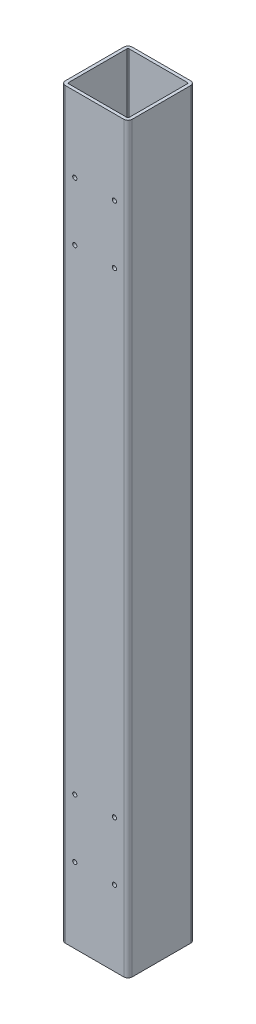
ISO-10303-21;
HEADER;
FILE_DESCRIPTION(('STEP AP214'),'2;1');
FILE_NAME('part.step','',(''),(''),'','','');
FILE_SCHEMA(('AUTOMOTIVE_DESIGN { 1 0 10303 214 1 1 1 1 }'));
ENDSEC;
DATA;
#1=APPLICATION_CONTEXT('core data for automotive mechanical design processes');
#2=APPLICATION_PROTOCOL_DEFINITION('international standard','automotive_design',2000,#1);
#3=PRODUCT_CONTEXT('',#1,'mechanical');
#4=PRODUCT('Part','Part','',(#3));
#5=PRODUCT_RELATED_PRODUCT_CATEGORY('part','',(#4));
#6=PRODUCT_DEFINITION_FORMATION('','',#4);
#7=PRODUCT_DEFINITION_CONTEXT('part definition',#1,'design');
#8=PRODUCT_DEFINITION('design','',#6,#7);
#9=PRODUCT_DEFINITION_SHAPE('','',#8);
#10=(LENGTH_UNIT() NAMED_UNIT(*) SI_UNIT(.MILLI.,.METRE.));
#11=(NAMED_UNIT(*) PLANE_ANGLE_UNIT() SI_UNIT($,.RADIAN.));
#12=(NAMED_UNIT(*) SI_UNIT($,.STERADIAN.) SOLID_ANGLE_UNIT());
#13=UNCERTAINTY_MEASURE_WITH_UNIT(LENGTH_MEASURE(1.E-05),#10,'distance_accuracy_value','');
#14=(GEOMETRIC_REPRESENTATION_CONTEXT(3) GLOBAL_UNCERTAINTY_ASSIGNED_CONTEXT((#13)) GLOBAL_UNIT_ASSIGNED_CONTEXT((#10,
#11,#12)) REPRESENTATION_CONTEXT('',''));
#15=CARTESIAN_POINT('',(0.,0.,0.));
#16=DIRECTION('',(0.,0.,1.));
#17=DIRECTION('',(1.,0.,0.));
#18=AXIS2_PLACEMENT_3D('',#15,#16,#17);
#19=CARTESIAN_POINT('',(-30.1624999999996,-450.849999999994,50.7999999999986));
#20=DIRECTION('',(0.,0.,1.));
#21=DIRECTION('',(1.,0.,0.));
#22=AXIS2_PLACEMENT_3D('',#19,#20,#21);
#23=CYLINDRICAL_SURFACE('',#22,3.175);
#24=CARTESIAN_POINT('',(-30.1624999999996,-450.849999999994,50.8));
#25=DIRECTION('',(0.,0.,1.));
#26=DIRECTION('',(1.,0.,0.));
#27=AXIS2_PLACEMENT_3D('',#24,#25,#26);
#28=CIRCLE('',#27,3.175);
#29=CARTESIAN_POINT('',(-33.3374999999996,-450.849999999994,50.8));
#30=VERTEX_POINT('',#29);
#31=CARTESIAN_POINT('',(-26.9874999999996,-450.849999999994,50.8));
#32=VERTEX_POINT('',#31);
#33=EDGE_CURVE('E361',#30,#32,#28,.F.);
#34=ORIENTED_EDGE('',*,*,#33,.F.);
#35=DIRECTION('',(0.,0.,1.));
#36=VECTOR('',#35,1.);
#37=CARTESIAN_POINT('',(-33.3374999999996,-450.849999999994,50.7999999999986));
#38=LINE('',#37,#36);
#39=CARTESIAN_POINT('',(-33.3374999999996,-450.849999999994,46.0375));
#40=VERTEX_POINT('',#39);
#41=EDGE_CURVE('E203',#30,#40,#38,.F.);
#42=ORIENTED_EDGE('',*,*,#41,.T.);
#43=CARTESIAN_POINT('',(-30.1624999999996,-450.849999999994,46.0375));
#44=DIRECTION('',(0.,0.,1.));
#45=DIRECTION('',(1.,0.,0.));
#46=AXIS2_PLACEMENT_3D('',#43,#44,#45);
#47=CIRCLE('',#46,3.175);
#48=CARTESIAN_POINT('',(-26.9874999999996,-450.849999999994,46.0375));
#49=VERTEX_POINT('',#48);
#50=EDGE_CURVE('E19',#40,#49,#47,.F.);
#51=ORIENTED_EDGE('',*,*,#50,.T.);
#52=DIRECTION('',(0.,0.,1.));
#53=VECTOR('',#52,1.);
#54=CARTESIAN_POINT('',(-26.9874999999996,-450.849999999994,50.7999999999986));
#55=LINE('',#54,#53);
#56=EDGE_CURVE('E195',#49,#32,#55,.T.);
#57=ORIENTED_EDGE('',*,*,#56,.T.);
#58=EDGE_LOOP('',(#34,#42,#51,#57));
#59=FACE_BOUND('',#58,.T.);
#60=ADVANCED_FACE('F16',(#59),#23,.F.);
#61=CARTESIAN_POINT('',(-30.1624999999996,-450.849999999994,50.7999999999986));
#62=DIRECTION('',(0.,0.,1.));
#63=DIRECTION('',(1.,0.,0.));
#64=AXIS2_PLACEMENT_3D('',#61,#62,#63);
#65=CYLINDRICAL_SURFACE('',#64,3.175);
#66=CARTESIAN_POINT('',(-30.1624999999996,-450.849999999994,46.0375));
#67=DIRECTION('',(0.,0.,1.));
#68=DIRECTION('',(1.,0.,0.));
#69=AXIS2_PLACEMENT_3D('',#66,#67,#68);
#70=CIRCLE('',#69,3.175);
#71=EDGE_CURVE('E197',#49,#40,#70,.F.);
#72=ORIENTED_EDGE('',*,*,#71,.T.);
#73=ORIENTED_EDGE('',*,*,#41,.F.);
#74=CARTESIAN_POINT('',(-30.1624999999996,-450.849999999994,50.8));
#75=DIRECTION('',(0.,0.,1.));
#76=DIRECTION('',(1.,0.,0.));
#77=AXIS2_PLACEMENT_3D('',#74,#75,#76);
#78=CIRCLE('',#77,3.175);
#79=EDGE_CURVE('E199',#32,#30,#78,.F.);
#80=ORIENTED_EDGE('',*,*,#79,.F.);
#81=ORIENTED_EDGE('',*,*,#56,.F.);
#82=EDGE_LOOP('',(#72,#73,#80,#81));
#83=FACE_BOUND('',#82,.T.);
#84=ADVANCED_FACE('F196',(#83),#65,.F.);
#85=CARTESIAN_POINT('',(30.1625000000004,-450.849999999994,50.7999999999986));
#86=DIRECTION('',(0.,0.,1.));
#87=DIRECTION('',(1.,0.,0.));
#88=AXIS2_PLACEMENT_3D('',#85,#86,#87);
#89=CYLINDRICAL_SURFACE('',#88,3.175);
#90=CARTESIAN_POINT('',(30.1625000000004,-450.849999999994,50.8));
#91=DIRECTION('',(0.,0.,1.));
#92=DIRECTION('',(1.,0.,0.));
#93=AXIS2_PLACEMENT_3D('',#90,#91,#92);
#94=CIRCLE('',#93,3.175);
#95=CARTESIAN_POINT('',(26.9875000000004,-450.849999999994,50.8));
#96=VERTEX_POINT('',#95);
#97=CARTESIAN_POINT('',(33.3375000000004,-450.849999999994,50.8));
#98=VERTEX_POINT('',#97);
#99=EDGE_CURVE('E358',#96,#98,#94,.F.);
#100=ORIENTED_EDGE('',*,*,#99,.F.);
#101=DIRECTION('',(0.,0.,1.));
#102=VECTOR('',#101,1.);
#103=CARTESIAN_POINT('',(26.9875000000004,-450.849999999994,50.7999999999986));
#104=LINE('',#103,#102);
#105=CARTESIAN_POINT('',(26.9875000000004,-450.849999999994,46.0375));
#106=VERTEX_POINT('',#105);
#107=EDGE_CURVE('E202',#96,#106,#104,.F.);
#108=ORIENTED_EDGE('',*,*,#107,.T.);
#109=CARTESIAN_POINT('',(30.1625000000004,-450.849999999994,46.0375));
#110=DIRECTION('',(0.,0.,1.));
#111=DIRECTION('',(1.,0.,0.));
#112=AXIS2_PLACEMENT_3D('',#109,#110,#111);
#113=CIRCLE('',#112,3.175);
#114=CARTESIAN_POINT('',(33.3375000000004,-450.849999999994,46.0375));
#115=VERTEX_POINT('',#114);
#116=EDGE_CURVE('E206',#106,#115,#113,.F.);
#117=ORIENTED_EDGE('',*,*,#116,.T.);
#118=DIRECTION('',(0.,0.,1.));
#119=VECTOR('',#118,1.);
#120=CARTESIAN_POINT('',(33.3375000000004,-450.849999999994,50.7999999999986));
#121=LINE('',#120,#119);
#122=EDGE_CURVE('E260',#115,#98,#121,.T.);
#123=ORIENTED_EDGE('',*,*,#122,.T.);
#124=EDGE_LOOP('',(#100,#108,#117,#123));
#125=FACE_BOUND('',#124,.T.);
#126=ADVANCED_FACE('F408',(#125),#89,.F.);
#127=CARTESIAN_POINT('',(30.1625000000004,-450.849999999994,50.7999999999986));
#128=DIRECTION('',(0.,0.,1.));
#129=DIRECTION('',(1.,0.,0.));
#130=AXIS2_PLACEMENT_3D('',#127,#128,#129);
#131=CYLINDRICAL_SURFACE('',#130,3.175);
#132=CARTESIAN_POINT('',(30.1625000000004,-450.849999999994,46.0375));
#133=DIRECTION('',(0.,0.,1.));
#134=DIRECTION('',(1.,0.,0.));
#135=AXIS2_PLACEMENT_3D('',#132,#133,#134);
#136=CIRCLE('',#135,3.175);
#137=EDGE_CURVE('E402',#115,#106,#136,.F.);
#138=ORIENTED_EDGE('',*,*,#137,.T.);
#139=ORIENTED_EDGE('',*,*,#107,.F.);
#140=CARTESIAN_POINT('',(30.1625000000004,-450.849999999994,50.8));
#141=DIRECTION('',(0.,0.,1.));
#142=DIRECTION('',(1.,0.,0.));
#143=AXIS2_PLACEMENT_3D('',#140,#141,#142);
#144=CIRCLE('',#143,3.175);
#145=EDGE_CURVE('E355',#98,#96,#144,.F.);
#146=ORIENTED_EDGE('',*,*,#145,.F.);
#147=ORIENTED_EDGE('',*,*,#122,.F.);
#148=EDGE_LOOP('',(#138,#139,#146,#147));
#149=FACE_BOUND('',#148,.T.);
#150=ADVANCED_FACE('F413',(#149),#131,.F.);
#151=CARTESIAN_POINT('',(-30.1624999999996,-361.949999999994,50.7999999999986));
#152=DIRECTION('',(0.,0.,1.));
#153=DIRECTION('',(1.,0.,0.));
#154=AXIS2_PLACEMENT_3D('',#151,#152,#153);
#155=CYLINDRICAL_SURFACE('',#154,3.175);
#156=CARTESIAN_POINT('',(-30.1624999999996,-361.949999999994,50.8));
#157=DIRECTION('',(0.,0.,1.));
#158=DIRECTION('',(1.,0.,0.));
#159=AXIS2_PLACEMENT_3D('',#156,#157,#158);
#160=CIRCLE('',#159,3.175);
#161=CARTESIAN_POINT('',(-33.3374999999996,-361.949999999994,50.8));
#162=VERTEX_POINT('',#161);
#163=CARTESIAN_POINT('',(-26.9874999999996,-361.949999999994,50.8));
#164=VERTEX_POINT('',#163);
#165=EDGE_CURVE('E352',#162,#164,#160,.F.);
#166=ORIENTED_EDGE('',*,*,#165,.F.);
#167=DIRECTION('',(0.,0.,1.));
#168=VECTOR('',#167,1.);
#169=CARTESIAN_POINT('',(-33.3374999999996,-361.949999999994,50.7999999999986));
#170=LINE('',#169,#168);
#171=CARTESIAN_POINT('',(-33.3374999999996,-361.949999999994,46.0375));
#172=VERTEX_POINT('',#171);
#173=EDGE_CURVE('E256',#162,#172,#170,.F.);
#174=ORIENTED_EDGE('',*,*,#173,.T.);
#175=CARTESIAN_POINT('',(-30.1624999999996,-361.949999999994,46.0375));
#176=DIRECTION('',(0.,0.,1.));
#177=DIRECTION('',(1.,0.,0.));
#178=AXIS2_PLACEMENT_3D('',#175,#176,#177);
#179=CIRCLE('',#178,3.175);
#180=CARTESIAN_POINT('',(-26.9874999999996,-361.949999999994,46.0375));
#181=VERTEX_POINT('',#180);
#182=EDGE_CURVE('E398',#172,#181,#179,.F.);
#183=ORIENTED_EDGE('',*,*,#182,.T.);
#184=DIRECTION('',(0.,0.,1.));
#185=VECTOR('',#184,1.);
#186=CARTESIAN_POINT('',(-26.9874999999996,-361.949999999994,50.7999999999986));
#187=LINE('',#186,#185);
#188=EDGE_CURVE('E252',#181,#164,#187,.T.);
#189=ORIENTED_EDGE('',*,*,#188,.T.);
#190=EDGE_LOOP('',(#166,#174,#183,#189));
#191=FACE_BOUND('',#190,.T.);
#192=ADVANCED_FACE('F671',(#191),#155,.F.);
#193=CARTESIAN_POINT('',(-30.1624999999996,-361.949999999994,50.7999999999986));
#194=DIRECTION('',(0.,0.,1.));
#195=DIRECTION('',(1.,0.,0.));
#196=AXIS2_PLACEMENT_3D('',#193,#194,#195);
#197=CYLINDRICAL_SURFACE('',#196,3.175);
#198=CARTESIAN_POINT('',(-30.1624999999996,-361.949999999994,46.0375));
#199=DIRECTION('',(0.,0.,1.));
#200=DIRECTION('',(1.,0.,0.));
#201=AXIS2_PLACEMENT_3D('',#198,#199,#200);
#202=CIRCLE('',#201,3.175);
#203=EDGE_CURVE('E394',#181,#172,#202,.F.);
#204=ORIENTED_EDGE('',*,*,#203,.T.);
#205=ORIENTED_EDGE('',*,*,#173,.F.);
#206=CARTESIAN_POINT('',(-30.1624999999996,-361.949999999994,50.8));
#207=DIRECTION('',(0.,0.,1.));
#208=DIRECTION('',(1.,0.,0.));
#209=AXIS2_PLACEMENT_3D('',#206,#207,#208);
#210=CIRCLE('',#209,3.175);
#211=EDGE_CURVE('E348',#164,#162,#210,.F.);
#212=ORIENTED_EDGE('',*,*,#211,.F.);
#213=ORIENTED_EDGE('',*,*,#188,.F.);
#214=EDGE_LOOP('',(#204,#205,#212,#213));
#215=FACE_BOUND('',#214,.T.);
#216=ADVANCED_FACE('F667',(#215),#197,.F.);
#217=CARTESIAN_POINT('',(30.1625000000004,-361.949999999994,50.7999999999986));
#218=DIRECTION('',(0.,0.,1.));
#219=DIRECTION('',(1.,0.,0.));
#220=AXIS2_PLACEMENT_3D('',#217,#218,#219);
#221=CYLINDRICAL_SURFACE('',#220,3.175);
#222=CARTESIAN_POINT('',(30.1625000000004,-361.949999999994,50.8));
#223=DIRECTION('',(0.,0.,1.));
#224=DIRECTION('',(1.,0.,0.));
#225=AXIS2_PLACEMENT_3D('',#222,#223,#224);
#226=CIRCLE('',#225,3.175);
#227=CARTESIAN_POINT('',(26.9875000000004,-361.949999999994,50.8));
#228=VERTEX_POINT('',#227);
#229=CARTESIAN_POINT('',(33.3375000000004,-361.949999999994,50.8));
#230=VERTEX_POINT('',#229);
#231=EDGE_CURVE('E346',#228,#230,#226,.F.);
#232=ORIENTED_EDGE('',*,*,#231,.F.);
#233=DIRECTION('',(0.,0.,1.));
#234=VECTOR('',#233,1.);
#235=CARTESIAN_POINT('',(26.9875000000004,-361.949999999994,50.7999999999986));
#236=LINE('',#235,#234);
#237=CARTESIAN_POINT('',(26.9875000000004,-361.949999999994,46.0375));
#238=VERTEX_POINT('',#237);
#239=EDGE_CURVE('E249',#228,#238,#236,.F.);
#240=ORIENTED_EDGE('',*,*,#239,.T.);
#241=CARTESIAN_POINT('',(30.1625000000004,-361.949999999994,46.0375));
#242=DIRECTION('',(0.,0.,1.));
#243=DIRECTION('',(1.,0.,0.));
#244=AXIS2_PLACEMENT_3D('',#241,#242,#243);
#245=CIRCLE('',#244,3.175);
#246=CARTESIAN_POINT('',(33.3375000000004,-361.949999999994,46.0375));
#247=VERTEX_POINT('',#246);
#248=EDGE_CURVE('E391',#238,#247,#245,.F.);
#249=ORIENTED_EDGE('',*,*,#248,.T.);
#250=DIRECTION('',(0.,0.,1.));
#251=VECTOR('',#250,1.);
#252=CARTESIAN_POINT('',(33.3375000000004,-361.949999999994,50.7999999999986));
#253=LINE('',#252,#251);
#254=EDGE_CURVE('E246',#247,#230,#253,.T.);
#255=ORIENTED_EDGE('',*,*,#254,.T.);
#256=EDGE_LOOP('',(#232,#240,#249,#255));
#257=FACE_BOUND('',#256,.T.);
#258=ADVANCED_FACE('F663',(#257),#221,.F.);
#259=CARTESIAN_POINT('',(30.1625000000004,-361.949999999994,50.7999999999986));
#260=DIRECTION('',(0.,0.,1.));
#261=DIRECTION('',(1.,0.,0.));
#262=AXIS2_PLACEMENT_3D('',#259,#260,#261);
#263=CYLINDRICAL_SURFACE('',#262,3.175);
#264=CARTESIAN_POINT('',(30.1625000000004,-361.949999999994,46.0375));
#265=DIRECTION('',(0.,0.,1.));
#266=DIRECTION('',(1.,0.,0.));
#267=AXIS2_PLACEMENT_3D('',#264,#265,#266);
#268=CIRCLE('',#267,3.175);
#269=EDGE_CURVE('E388',#247,#238,#268,.F.);
#270=ORIENTED_EDGE('',*,*,#269,.T.);
#271=ORIENTED_EDGE('',*,*,#239,.F.);
#272=CARTESIAN_POINT('',(30.1625000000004,-361.949999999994,50.8));
#273=DIRECTION('',(0.,0.,1.));
#274=DIRECTION('',(1.,0.,0.));
#275=AXIS2_PLACEMENT_3D('',#272,#273,#274);
#276=CIRCLE('',#275,3.175);
#277=EDGE_CURVE('E343',#230,#228,#276,.F.);
#278=ORIENTED_EDGE('',*,*,#277,.F.);
#279=ORIENTED_EDGE('',*,*,#254,.F.);
#280=EDGE_LOOP('',(#270,#271,#278,#279));
#281=FACE_BOUND('',#280,.T.);
#282=ADVANCED_FACE('F659',(#281),#263,.F.);
#283=CARTESIAN_POINT('',(-30.1624999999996,361.950000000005,50.7999999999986));
#284=DIRECTION('',(0.,0.,1.));
#285=DIRECTION('',(1.,0.,0.));
#286=AXIS2_PLACEMENT_3D('',#283,#284,#285);
#287=CYLINDRICAL_SURFACE('',#286,3.175);
#288=CARTESIAN_POINT('',(-30.1624999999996,361.950000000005,50.8));
#289=DIRECTION('',(0.,0.,1.));
#290=DIRECTION('',(1.,0.,0.));
#291=AXIS2_PLACEMENT_3D('',#288,#289,#290);
#292=CIRCLE('',#291,3.175);
#293=CARTESIAN_POINT('',(-33.3374999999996,361.950000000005,50.8));
#294=VERTEX_POINT('',#293);
#295=CARTESIAN_POINT('',(-26.9874999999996,361.950000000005,50.8));
#296=VERTEX_POINT('',#295);
#297=EDGE_CURVE('E341',#294,#296,#292,.F.);
#298=ORIENTED_EDGE('',*,*,#297,.F.);
#299=DIRECTION('',(0.,0.,1.));
#300=VECTOR('',#299,1.);
#301=CARTESIAN_POINT('',(-33.3374999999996,361.950000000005,50.7999999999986));
#302=LINE('',#301,#300);
#303=CARTESIAN_POINT('',(-33.3374999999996,361.950000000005,46.0375));
#304=VERTEX_POINT('',#303);
#305=EDGE_CURVE('E243',#294,#304,#302,.F.);
#306=ORIENTED_EDGE('',*,*,#305,.T.);
#307=CARTESIAN_POINT('',(-30.1624999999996,361.950000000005,46.0375));
#308=DIRECTION('',(0.,0.,1.));
#309=DIRECTION('',(1.,0.,0.));
#310=AXIS2_PLACEMENT_3D('',#307,#308,#309);
#311=CIRCLE('',#310,3.175);
#312=CARTESIAN_POINT('',(-26.9874999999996,361.950000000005,46.0375));
#313=VERTEX_POINT('',#312);
#314=EDGE_CURVE('E385',#304,#313,#311,.F.);
#315=ORIENTED_EDGE('',*,*,#314,.T.);
#316=DIRECTION('',(0.,0.,1.));
#317=VECTOR('',#316,1.);
#318=CARTESIAN_POINT('',(-26.9874999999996,361.950000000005,50.7999999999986));
#319=LINE('',#318,#317);
#320=EDGE_CURVE('E240',#313,#296,#319,.T.);
#321=ORIENTED_EDGE('',*,*,#320,.T.);
#322=EDGE_LOOP('',(#298,#306,#315,#321));
#323=FACE_BOUND('',#322,.T.);
#324=ADVANCED_FACE('F655',(#323),#287,.F.);
#325=CARTESIAN_POINT('',(-30.1624999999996,361.950000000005,50.7999999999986));
#326=DIRECTION('',(0.,0.,1.));
#327=DIRECTION('',(1.,0.,0.));
#328=AXIS2_PLACEMENT_3D('',#325,#326,#327);
#329=CYLINDRICAL_SURFACE('',#328,3.175);
#330=CARTESIAN_POINT('',(-30.1624999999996,361.950000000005,46.0375));
#331=DIRECTION('',(0.,0.,1.));
#332=DIRECTION('',(1.,0.,0.));
#333=AXIS2_PLACEMENT_3D('',#330,#331,#332);
#334=CIRCLE('',#333,3.175);
#335=EDGE_CURVE('E382',#313,#304,#334,.F.);
#336=ORIENTED_EDGE('',*,*,#335,.T.);
#337=ORIENTED_EDGE('',*,*,#305,.F.);
#338=CARTESIAN_POINT('',(-30.1624999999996,361.950000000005,50.8));
#339=DIRECTION('',(0.,0.,1.));
#340=DIRECTION('',(1.,0.,0.));
#341=AXIS2_PLACEMENT_3D('',#338,#339,#340);
#342=CIRCLE('',#341,3.175);
#343=EDGE_CURVE('E338',#296,#294,#342,.F.);
#344=ORIENTED_EDGE('',*,*,#343,.F.);
#345=ORIENTED_EDGE('',*,*,#320,.F.);
#346=EDGE_LOOP('',(#336,#337,#344,#345));
#347=FACE_BOUND('',#346,.T.);
#348=ADVANCED_FACE('F651',(#347),#329,.F.);
#349=CARTESIAN_POINT('',(30.1625000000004,361.950000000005,50.7999999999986));
#350=DIRECTION('',(0.,0.,1.));
#351=DIRECTION('',(1.,0.,0.));
#352=AXIS2_PLACEMENT_3D('',#349,#350,#351);
#353=CYLINDRICAL_SURFACE('',#352,3.175);
#354=CARTESIAN_POINT('',(30.1625000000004,361.950000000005,50.8));
#355=DIRECTION('',(0.,0.,1.));
#356=DIRECTION('',(1.,0.,0.));
#357=AXIS2_PLACEMENT_3D('',#354,#355,#356);
#358=CIRCLE('',#357,3.175);
#359=CARTESIAN_POINT('',(26.9875000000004,361.950000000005,50.8));
#360=VERTEX_POINT('',#359);
#361=CARTESIAN_POINT('',(33.3375000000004,361.950000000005,50.8));
#362=VERTEX_POINT('',#361);
#363=EDGE_CURVE('E336',#360,#362,#358,.F.);
#364=ORIENTED_EDGE('',*,*,#363,.F.);
#365=DIRECTION('',(0.,0.,1.));
#366=VECTOR('',#365,1.);
#367=CARTESIAN_POINT('',(26.9875000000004,361.950000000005,50.7999999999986));
#368=LINE('',#367,#366);
#369=CARTESIAN_POINT('',(26.9875000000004,361.950000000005,46.0375));
#370=VERTEX_POINT('',#369);
#371=EDGE_CURVE('E237',#360,#370,#368,.F.);
#372=ORIENTED_EDGE('',*,*,#371,.T.);
#373=CARTESIAN_POINT('',(30.1625000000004,361.950000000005,46.0375));
#374=DIRECTION('',(0.,0.,1.));
#375=DIRECTION('',(1.,0.,0.));
#376=AXIS2_PLACEMENT_3D('',#373,#374,#375);
#377=CIRCLE('',#376,3.175);
#378=CARTESIAN_POINT('',(33.3375000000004,361.950000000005,46.0375));
#379=VERTEX_POINT('',#378);
#380=EDGE_CURVE('E379',#370,#379,#377,.F.);
#381=ORIENTED_EDGE('',*,*,#380,.T.);
#382=DIRECTION('',(0.,0.,1.));
#383=VECTOR('',#382,1.);
#384=CARTESIAN_POINT('',(33.3375000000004,361.950000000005,50.7999999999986));
#385=LINE('',#384,#383);
#386=EDGE_CURVE('E234',#379,#362,#385,.T.);
#387=ORIENTED_EDGE('',*,*,#386,.T.);
#388=EDGE_LOOP('',(#364,#372,#381,#387));
#389=FACE_BOUND('',#388,.T.);
#390=ADVANCED_FACE('F647',(#389),#353,.F.);
#391=CARTESIAN_POINT('',(30.1625000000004,361.950000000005,50.7999999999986));
#392=DIRECTION('',(0.,0.,1.));
#393=DIRECTION('',(1.,0.,0.));
#394=AXIS2_PLACEMENT_3D('',#391,#392,#393);
#395=CYLINDRICAL_SURFACE('',#394,3.175);
#396=CARTESIAN_POINT('',(30.1625000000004,361.950000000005,46.0375));
#397=DIRECTION('',(0.,0.,1.));
#398=DIRECTION('',(1.,0.,0.));
#399=AXIS2_PLACEMENT_3D('',#396,#397,#398);
#400=CIRCLE('',#399,3.175);
#401=EDGE_CURVE('E376',#379,#370,#400,.F.);
#402=ORIENTED_EDGE('',*,*,#401,.T.);
#403=ORIENTED_EDGE('',*,*,#371,.F.);
#404=CARTESIAN_POINT('',(30.1625000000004,361.950000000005,50.8));
#405=DIRECTION('',(0.,0.,1.));
#406=DIRECTION('',(1.,0.,0.));
#407=AXIS2_PLACEMENT_3D('',#404,#405,#406);
#408=CIRCLE('',#407,3.175);
#409=EDGE_CURVE('E333',#362,#360,#408,.F.);
#410=ORIENTED_EDGE('',*,*,#409,.F.);
#411=ORIENTED_EDGE('',*,*,#386,.F.);
#412=EDGE_LOOP('',(#402,#403,#410,#411));
#413=FACE_BOUND('',#412,.T.);
#414=ADVANCED_FACE('F643',(#413),#395,.F.);
#415=CARTESIAN_POINT('',(-30.1624999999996,450.850000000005,50.7999999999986));
#416=DIRECTION('',(0.,0.,1.));
#417=DIRECTION('',(1.,0.,0.));
#418=AXIS2_PLACEMENT_3D('',#415,#416,#417);
#419=CYLINDRICAL_SURFACE('',#418,3.175);
#420=CARTESIAN_POINT('',(-30.1624999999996,450.850000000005,50.8));
#421=DIRECTION('',(0.,0.,1.));
#422=DIRECTION('',(1.,0.,0.));
#423=AXIS2_PLACEMENT_3D('',#420,#421,#422);
#424=CIRCLE('',#423,3.175);
#425=CARTESIAN_POINT('',(-33.3374999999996,450.850000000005,50.8));
#426=VERTEX_POINT('',#425);
#427=CARTESIAN_POINT('',(-26.9874999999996,450.850000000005,50.8));
#428=VERTEX_POINT('',#427);
#429=EDGE_CURVE('E331',#426,#428,#424,.F.);
#430=ORIENTED_EDGE('',*,*,#429,.F.);
#431=DIRECTION('',(0.,0.,1.));
#432=VECTOR('',#431,1.);
#433=CARTESIAN_POINT('',(-33.3374999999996,450.850000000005,50.7999999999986));
#434=LINE('',#433,#432);
#435=CARTESIAN_POINT('',(-33.3374999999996,450.850000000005,46.0375));
#436=VERTEX_POINT('',#435);
#437=EDGE_CURVE('E231',#426,#436,#434,.F.);
#438=ORIENTED_EDGE('',*,*,#437,.T.);
#439=CARTESIAN_POINT('',(-30.1624999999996,450.850000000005,46.0375));
#440=DIRECTION('',(0.,0.,1.));
#441=DIRECTION('',(1.,0.,0.));
#442=AXIS2_PLACEMENT_3D('',#439,#440,#441);
#443=CIRCLE('',#442,3.175);
#444=CARTESIAN_POINT('',(-26.9874999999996,450.850000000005,46.0375));
#445=VERTEX_POINT('',#444);
#446=EDGE_CURVE('E373',#436,#445,#443,.F.);
#447=ORIENTED_EDGE('',*,*,#446,.T.);
#448=DIRECTION('',(0.,0.,1.));
#449=VECTOR('',#448,1.);
#450=CARTESIAN_POINT('',(-26.9874999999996,450.850000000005,50.7999999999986));
#451=LINE('',#450,#449);
#452=EDGE_CURVE('E228',#445,#428,#451,.T.);
#453=ORIENTED_EDGE('',*,*,#452,.T.);
#454=EDGE_LOOP('',(#430,#438,#447,#453));
#455=FACE_BOUND('',#454,.T.);
#456=ADVANCED_FACE('F639',(#455),#419,.F.);
#457=CARTESIAN_POINT('',(-30.1624999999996,450.850000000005,50.7999999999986));
#458=DIRECTION('',(0.,0.,1.));
#459=DIRECTION('',(1.,0.,0.));
#460=AXIS2_PLACEMENT_3D('',#457,#458,#459);
#461=CYLINDRICAL_SURFACE('',#460,3.175);
#462=CARTESIAN_POINT('',(-30.1624999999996,450.850000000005,46.0375));
#463=DIRECTION('',(0.,0.,1.));
#464=DIRECTION('',(1.,0.,0.));
#465=AXIS2_PLACEMENT_3D('',#462,#463,#464);
#466=CIRCLE('',#465,3.175);
#467=EDGE_CURVE('E370',#445,#436,#466,.F.);
#468=ORIENTED_EDGE('',*,*,#467,.T.);
#469=ORIENTED_EDGE('',*,*,#437,.F.);
#470=CARTESIAN_POINT('',(-30.1624999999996,450.850000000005,50.8));
#471=DIRECTION('',(0.,0.,1.));
#472=DIRECTION('',(1.,0.,0.));
#473=AXIS2_PLACEMENT_3D('',#470,#471,#472);
#474=CIRCLE('',#473,3.175);
#475=EDGE_CURVE('E328',#428,#426,#474,.F.);
#476=ORIENTED_EDGE('',*,*,#475,.F.);
#477=ORIENTED_EDGE('',*,*,#452,.F.);
#478=EDGE_LOOP('',(#468,#469,#476,#477));
#479=FACE_BOUND('',#478,.T.);
#480=ADVANCED_FACE('F635',(#479),#461,.F.);
#481=CARTESIAN_POINT('',(30.1625000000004,450.850000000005,50.7999999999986));
#482=DIRECTION('',(0.,0.,1.));
#483=DIRECTION('',(1.,0.,0.));
#484=AXIS2_PLACEMENT_3D('',#481,#482,#483);
#485=CYLINDRICAL_SURFACE('',#484,3.175);
#486=CARTESIAN_POINT('',(30.1625000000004,450.850000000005,50.8));
#487=DIRECTION('',(0.,0.,1.));
#488=DIRECTION('',(1.,0.,0.));
#489=AXIS2_PLACEMENT_3D('',#486,#487,#488);
#490=CIRCLE('',#489,3.175);
#491=CARTESIAN_POINT('',(26.9875000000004,450.850000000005,50.8));
#492=VERTEX_POINT('',#491);
#493=CARTESIAN_POINT('',(33.3375000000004,450.850000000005,50.8));
#494=VERTEX_POINT('',#493);
#495=EDGE_CURVE('E326',#492,#494,#490,.F.);
#496=ORIENTED_EDGE('',*,*,#495,.F.);
#497=DIRECTION('',(0.,0.,1.));
#498=VECTOR('',#497,1.);
#499=CARTESIAN_POINT('',(26.9875000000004,450.850000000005,50.7999999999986));
#500=LINE('',#499,#498);
#501=CARTESIAN_POINT('',(26.9875000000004,450.850000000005,46.0375));
#502=VERTEX_POINT('',#501);
#503=EDGE_CURVE('E216',#492,#502,#500,.F.);
#504=ORIENTED_EDGE('',*,*,#503,.T.);
#505=CARTESIAN_POINT('',(30.1625000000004,450.850000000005,46.0375));
#506=DIRECTION('',(0.,0.,1.));
#507=DIRECTION('',(1.,0.,0.));
#508=AXIS2_PLACEMENT_3D('',#505,#506,#507);
#509=CIRCLE('',#508,3.175);
#510=CARTESIAN_POINT('',(33.3375000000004,450.850000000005,46.0375));
#511=VERTEX_POINT('',#510);
#512=EDGE_CURVE('E367',#502,#511,#509,.F.);
#513=ORIENTED_EDGE('',*,*,#512,.T.);
#514=DIRECTION('',(0.,0.,1.));
#515=VECTOR('',#514,1.);
#516=CARTESIAN_POINT('',(33.3375000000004,450.850000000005,50.7999999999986));
#517=LINE('',#516,#515);
#518=EDGE_CURVE('E209',#511,#494,#517,.T.);
#519=ORIENTED_EDGE('',*,*,#518,.T.);
#520=EDGE_LOOP('',(#496,#504,#513,#519));
#521=FACE_BOUND('',#520,.T.);
#522=ADVANCED_FACE('F631',(#521),#485,.F.);
#523=CARTESIAN_POINT('',(30.1625000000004,450.850000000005,50.7999999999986));
#524=DIRECTION('',(0.,0.,1.));
#525=DIRECTION('',(1.,0.,0.));
#526=AXIS2_PLACEMENT_3D('',#523,#524,#525);
#527=CYLINDRICAL_SURFACE('',#526,3.175);
#528=CARTESIAN_POINT('',(30.1625000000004,450.850000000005,46.0375));
#529=DIRECTION('',(0.,0.,1.));
#530=DIRECTION('',(1.,0.,0.));
#531=AXIS2_PLACEMENT_3D('',#528,#529,#530);
#532=CIRCLE('',#531,3.175);
#533=EDGE_CURVE('E364',#511,#502,#532,.F.);
#534=ORIENTED_EDGE('',*,*,#533,.T.);
#535=ORIENTED_EDGE('',*,*,#503,.F.);
#536=CARTESIAN_POINT('',(30.1625000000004,450.850000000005,50.8));
#537=DIRECTION('',(0.,0.,1.));
#538=DIRECTION('',(1.,0.,0.));
#539=AXIS2_PLACEMENT_3D('',#536,#537,#538);
#540=CIRCLE('',#539,3.175);
#541=EDGE_CURVE('E322',#494,#492,#540,.F.);
#542=ORIENTED_EDGE('',*,*,#541,.F.);
#543=ORIENTED_EDGE('',*,*,#518,.F.);
#544=EDGE_LOOP('',(#534,#535,#542,#543));
#545=FACE_BOUND('',#544,.T.);
#546=ADVANCED_FACE('F628',(#545),#527,.F.);
#547=CARTESIAN_POINT('',(46.0375000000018,565.15,44.45));
#548=DIRECTION('',(1.,0.,0.));
#549=DIRECTION('',(0.,0.,-1.));
#550=AXIS2_PLACEMENT_3D('',#547,#548,#549);
#551=PLANE('',#550);
#552=DIRECTION('',(0.,-1.,0.));
#553=VECTOR('',#552,1.);
#554=CARTESIAN_POINT('',(46.0375000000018,565.15,44.45));
#555=LINE('',#554,#553);
#556=CARTESIAN_POINT('',(46.0375000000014,-565.15,44.45));
#557=VERTEX_POINT('',#556);
#558=CARTESIAN_POINT('',(46.0375000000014,565.15,44.45));
#559=VERTEX_POINT('',#558);
#560=EDGE_CURVE('E207',#557,#559,#555,.F.);
#561=ORIENTED_EDGE('',*,*,#560,.T.);
#562=DIRECTION('',(0.,0.,1.));
#563=VECTOR('',#562,1.);
#564=CARTESIAN_POINT('',(46.0375000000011,565.15,0.));
#565=LINE('',#564,#563);
#566=CARTESIAN_POINT('',(46.037500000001,565.15,-44.45));
#567=VERTEX_POINT('',#566);
#568=EDGE_CURVE('E318',#567,#559,#565,.T.);
#569=ORIENTED_EDGE('',*,*,#568,.F.);
#570=DIRECTION('',(0.,-1.,0.));
#571=VECTOR('',#570,1.);
#572=CARTESIAN_POINT('',(46.037500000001,565.15,-44.45));
#573=LINE('',#572,#571);
#574=CARTESIAN_POINT('',(46.037500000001,-565.15,-44.45));
#575=VERTEX_POINT('',#574);
#576=EDGE_CURVE('E222',#567,#575,#573,.T.);
#577=ORIENTED_EDGE('',*,*,#576,.T.);
#578=DIRECTION('',(0.,0.,1.));
#579=VECTOR('',#578,1.);
#580=CARTESIAN_POINT('',(46.0375000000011,-565.15,-50.8));
#581=LINE('',#580,#579);
#582=EDGE_CURVE('E294',#575,#557,#581,.T.);
#583=ORIENTED_EDGE('',*,*,#582,.T.);
#584=EDGE_LOOP('',(#561,#569,#577,#583));
#585=FACE_BOUND('',#584,.T.);
#586=ADVANCED_FACE('F546',(#585),#551,.F.);
#587=CARTESIAN_POINT('',(44.4500000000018,565.15,44.45));
#588=DIRECTION('',(0.,-1.,0.));
#589=DIRECTION('',(0.,0.,-1.));
#590=AXIS2_PLACEMENT_3D('',#587,#588,#589);
#591=CYLINDRICAL_SURFACE('',#590,1.5875);
#592=DIRECTION('',(0.,1.,0.));
#593=VECTOR('',#592,1.);
#594=CARTESIAN_POINT('',(44.4500000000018,565.15,46.0375));
#595=LINE('',#594,#593);
#596=CARTESIAN_POINT('',(44.4500000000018,-565.15,46.0375));
#597=VERTEX_POINT('',#596);
#598=CARTESIAN_POINT('',(44.4500000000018,565.15,46.0375));
#599=VERTEX_POINT('',#598);
#600=EDGE_CURVE('E220',#597,#599,#595,.T.);
#601=ORIENTED_EDGE('',*,*,#600,.T.);
#602=CARTESIAN_POINT('',(44.4500000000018,565.15,44.45));
#603=DIRECTION('',(0.,-1.,0.));
#604=DIRECTION('',(0.,0.,-1.));
#605=AXIS2_PLACEMENT_3D('',#602,#603,#604);
#606=CIRCLE('',#605,1.5875);
#607=EDGE_CURVE('E316',#559,#599,#606,.T.);
#608=ORIENTED_EDGE('',*,*,#607,.F.);
#609=ORIENTED_EDGE('',*,*,#560,.F.);
#610=CARTESIAN_POINT('',(44.4500000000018,-565.15,44.45));
#611=DIRECTION('',(0.,-1.,0.));
#612=DIRECTION('',(0.,0.,-1.));
#613=AXIS2_PLACEMENT_3D('',#610,#611,#612);
#614=CIRCLE('',#613,1.5875);
#615=EDGE_CURVE('E291',#557,#597,#614,.T.);
#616=ORIENTED_EDGE('',*,*,#615,.T.);
#617=EDGE_LOOP('',(#601,#608,#609,#616));
#618=FACE_BOUND('',#617,.T.);
#619=ADVANCED_FACE('F539',(#618),#591,.F.);
#620=CARTESIAN_POINT('',(-44.4500000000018,565.15,46.0375));
#621=DIRECTION('',(0.,0.,1.));
#622=DIRECTION('',(1.,0.,0.));
#623=AXIS2_PLACEMENT_3D('',#620,#621,#622);
#624=PLANE('',#623);
#625=DIRECTION('',(0.,-1.,0.));
#626=VECTOR('',#625,1.);
#627=CARTESIAN_POINT('',(-44.4500000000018,565.15,46.0375000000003));
#628=LINE('',#627,#626);
#629=CARTESIAN_POINT('',(-44.4500000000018,-565.15,46.0375000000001));
#630=VERTEX_POINT('',#629);
#631=CARTESIAN_POINT('',(-44.4500000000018,565.15,46.0375000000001));
#632=VERTEX_POINT('',#631);
#633=EDGE_CURVE('E527',#630,#632,#628,.F.);
#634=ORIENTED_EDGE('',*,*,#633,.T.);
#635=DIRECTION('',(1.,0.,0.));
#636=VECTOR('',#635,1.);
#637=CARTESIAN_POINT('',(3.60955709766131E-13,565.15,46.0375));
#638=LINE('',#637,#636);
#639=EDGE_CURVE('E315',#599,#632,#638,.F.);
#640=ORIENTED_EDGE('',*,*,#639,.F.);
#641=ORIENTED_EDGE('',*,*,#600,.F.);
#642=DIRECTION('',(1.,0.,0.));
#643=VECTOR('',#642,1.);
#644=CARTESIAN_POINT('',(-44.4500000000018,-565.15,46.0375));
#645=LINE('',#644,#643);
#646=EDGE_CURVE('E290',#597,#630,#645,.F.);
#647=ORIENTED_EDGE('',*,*,#646,.T.);
#648=EDGE_LOOP('',(#634,#640,#641,#647));
#649=FACE_BOUND('',#648,.T.);
#650=ORIENTED_EDGE('',*,*,#512,.F.);
#651=ORIENTED_EDGE('',*,*,#533,.F.);
#652=EDGE_LOOP('',(#650,#651));
#653=FACE_BOUND('',#652,.T.);
#654=ORIENTED_EDGE('',*,*,#446,.F.);
#655=ORIENTED_EDGE('',*,*,#467,.F.);
#656=EDGE_LOOP('',(#654,#655));
#657=FACE_BOUND('',#656,.T.);
#658=ORIENTED_EDGE('',*,*,#380,.F.);
#659=ORIENTED_EDGE('',*,*,#401,.F.);
#660=EDGE_LOOP('',(#658,#659));
#661=FACE_BOUND('',#660,.T.);
#662=ORIENTED_EDGE('',*,*,#314,.F.);
#663=ORIENTED_EDGE('',*,*,#335,.F.);
#664=EDGE_LOOP('',(#662,#663));
#665=FACE_BOUND('',#664,.T.);
#666=ORIENTED_EDGE('',*,*,#248,.F.);
#667=ORIENTED_EDGE('',*,*,#269,.F.);
#668=EDGE_LOOP('',(#666,#667));
#669=FACE_BOUND('',#668,.T.);
#670=ORIENTED_EDGE('',*,*,#182,.F.);
#671=ORIENTED_EDGE('',*,*,#203,.F.);
#672=EDGE_LOOP('',(#670,#671));
#673=FACE_BOUND('',#672,.T.);
#674=ORIENTED_EDGE('',*,*,#116,.F.);
#675=ORIENTED_EDGE('',*,*,#137,.F.);
#676=EDGE_LOOP('',(#674,#675));
#677=FACE_BOUND('',#676,.T.);
#678=ORIENTED_EDGE('',*,*,#50,.F.);
#679=ORIENTED_EDGE('',*,*,#71,.F.);
#680=EDGE_LOOP('',(#678,#679));
#681=FACE_BOUND('',#680,.T.);
#682=ADVANCED_FACE('F205',(#649,#653,#657,#661,#665,#669,#673,#677,#681),#624,.F.);
#683=CARTESIAN_POINT('',(-44.4500000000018,565.15,44.4500000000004));
#684=DIRECTION('',(0.,-1.,0.));
#685=DIRECTION('',(0.,0.,-1.));
#686=AXIS2_PLACEMENT_3D('',#683,#684,#685);
#687=CYLINDRICAL_SURFACE('',#686,1.58749999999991);
#688=DIRECTION('',(0.,1.,0.));
#689=VECTOR('',#688,1.);
#690=CARTESIAN_POINT('',(-46.0375000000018,565.15,44.4500000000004));
#691=LINE('',#690,#689);
#692=CARTESIAN_POINT('',(-46.0375000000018,-565.15,44.4500000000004));
#693=VERTEX_POINT('',#692);
#694=CARTESIAN_POINT('',(-46.0375000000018,565.15,44.4500000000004));
#695=VERTEX_POINT('',#694);
#696=EDGE_CURVE('E522',#693,#695,#691,.T.);
#697=ORIENTED_EDGE('',*,*,#696,.T.);
#698=CARTESIAN_POINT('',(-44.4500000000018,565.15,44.4500000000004));
#699=DIRECTION('',(0.,-1.,0.));
#700=DIRECTION('',(0.,0.,-1.));
#701=AXIS2_PLACEMENT_3D('',#698,#699,#700);
#702=CIRCLE('',#701,1.58749999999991);
#703=EDGE_CURVE('E312',#632,#695,#702,.T.);
#704=ORIENTED_EDGE('',*,*,#703,.F.);
#705=ORIENTED_EDGE('',*,*,#633,.F.);
#706=CARTESIAN_POINT('',(-44.4500000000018,-565.15,44.4500000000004));
#707=DIRECTION('',(0.,-1.,0.));
#708=DIRECTION('',(0.,0.,-1.));
#709=AXIS2_PLACEMENT_3D('',#706,#707,#708);
#710=CIRCLE('',#709,1.58749999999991);
#711=EDGE_CURVE('E287',#630,#693,#710,.T.);
#712=ORIENTED_EDGE('',*,*,#711,.T.);
#713=EDGE_LOOP('',(#697,#704,#705,#712));
#714=FACE_BOUND('',#713,.T.);
#715=ADVANCED_FACE('F614',(#714),#687,.F.);
#716=CARTESIAN_POINT('',(-46.0375000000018,565.15,-44.45));
#717=DIRECTION('',(-1.,0.,0.));
#718=DIRECTION('',(0.,0.,1.));
#719=AXIS2_PLACEMENT_3D('',#716,#717,#718);
#720=PLANE('',#719);
#721=DIRECTION('',(0.,-1.,0.));
#722=VECTOR('',#721,1.);
#723=CARTESIAN_POINT('',(-46.0375000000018,565.15,-44.45));
#724=LINE('',#723,#722);
#725=CARTESIAN_POINT('',(-46.0375000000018,-565.15,-44.45));
#726=VERTEX_POINT('',#725);
#727=CARTESIAN_POINT('',(-46.0375000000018,565.15,-44.45));
#728=VERTEX_POINT('',#727);
#729=EDGE_CURVE('E321',#726,#728,#724,.F.);
#730=ORIENTED_EDGE('',*,*,#729,.T.);
#731=DIRECTION('',(0.,0.,1.));
#732=VECTOR('',#731,1.);
#733=CARTESIAN_POINT('',(-46.0375000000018,565.15,0.));
#734=LINE('',#733,#732);
#735=EDGE_CURVE('E314',#695,#728,#734,.F.);
#736=ORIENTED_EDGE('',*,*,#735,.F.);
#737=ORIENTED_EDGE('',*,*,#696,.F.);
#738=DIRECTION('',(0.,0.,1.));
#739=VECTOR('',#738,1.);
#740=CARTESIAN_POINT('',(-46.0375000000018,-565.15,-50.8));
#741=LINE('',#740,#739);
#742=EDGE_CURVE('E286',#693,#726,#741,.F.);
#743=ORIENTED_EDGE('',*,*,#742,.T.);
#744=EDGE_LOOP('',(#730,#736,#737,#743));
#745=FACE_BOUND('',#744,.T.);
#746=ADVANCED_FACE('F612',(#745),#720,.F.);
#747=CARTESIAN_POINT('',(-50.8000000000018,565.15,-44.4499999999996));
#748=DIRECTION('',(-1.,0.,0.));
#749=DIRECTION('',(0.,0.,1.));
#750=AXIS2_PLACEMENT_3D('',#747,#748,#749);
#751=PLANE('',#750);
#752=DIRECTION('',(0.,0.,1.));
#753=VECTOR('',#752,1.);
#754=CARTESIAN_POINT('',(-50.8000000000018,565.15,0.));
#755=LINE('',#754,#753);
#756=CARTESIAN_POINT('',(-50.8000000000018,565.15,-44.4499999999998));
#757=VERTEX_POINT('',#756);
#758=CARTESIAN_POINT('',(-50.8000000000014,565.15,44.4500000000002));
#759=VERTEX_POINT('',#758);
#760=EDGE_CURVE('E307',#757,#759,#755,.T.);
#761=ORIENTED_EDGE('',*,*,#760,.F.);
#762=DIRECTION('',(0.,-1.,0.));
#763=VECTOR('',#762,1.);
#764=CARTESIAN_POINT('',(-50.8000000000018,565.15,-44.4499999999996));
#765=LINE('',#764,#763);
#766=CARTESIAN_POINT('',(-50.8000000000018,-565.15,-44.4499999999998));
#767=VERTEX_POINT('',#766);
#768=EDGE_CURVE('E503',#767,#757,#765,.F.);
#769=ORIENTED_EDGE('',*,*,#768,.F.);
#770=DIRECTION('',(0.,0.,1.));
#771=VECTOR('',#770,1.);
#772=CARTESIAN_POINT('',(-50.8000000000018,-565.15,-50.8));
#773=LINE('',#772,#771);
#774=CARTESIAN_POINT('',(-50.8000000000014,-565.15,44.4500000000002));
#775=VERTEX_POINT('',#774);
#776=EDGE_CURVE('E282',#767,#775,#773,.T.);
#777=ORIENTED_EDGE('',*,*,#776,.T.);
#778=DIRECTION('',(0.,-1.,0.));
#779=VECTOR('',#778,1.);
#780=CARTESIAN_POINT('',(-50.8000000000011,565.15,44.4500000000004));
#781=LINE('',#780,#779);
#782=EDGE_CURVE('E363',#759,#775,#781,.T.);
#783=ORIENTED_EDGE('',*,*,#782,.F.);
#784=EDGE_LOOP('',(#761,#769,#777,#783));
#785=FACE_BOUND('',#784,.T.);
#786=ADVANCED_FACE('F430',(#785),#751,.T.);
#787=CARTESIAN_POINT('',(-44.4500000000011,565.15,44.45));
#788=DIRECTION('',(0.,-1.,0.));
#789=DIRECTION('',(0.,0.,-1.));
#790=AXIS2_PLACEMENT_3D('',#787,#788,#789);
#791=CYLINDRICAL_SURFACE('',#790,6.35);
#792=CARTESIAN_POINT('',(-44.4500000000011,565.15,44.45));
#793=DIRECTION('',(0.,-1.,0.));
#794=DIRECTION('',(0.,0.,-1.));
#795=AXIS2_PLACEMENT_3D('',#792,#793,#794);
#796=CIRCLE('',#795,6.35);
#797=CARTESIAN_POINT('',(-44.4500000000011,565.15,50.8));
#798=VERTEX_POINT('',#797);
#799=EDGE_CURVE('E305',#759,#798,#796,.F.);
#800=ORIENTED_EDGE('',*,*,#799,.F.);
#801=ORIENTED_EDGE('',*,*,#782,.T.);
#802=CARTESIAN_POINT('',(-44.4500000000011,-565.15,44.45));
#803=DIRECTION('',(0.,-1.,0.));
#804=DIRECTION('',(0.,0.,-1.));
#805=AXIS2_PLACEMENT_3D('',#802,#803,#804);
#806=CIRCLE('',#805,6.35);
#807=CARTESIAN_POINT('',(-44.4500000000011,-565.15,50.8));
#808=VERTEX_POINT('',#807);
#809=EDGE_CURVE('E279',#775,#808,#806,.F.);
#810=ORIENTED_EDGE('',*,*,#809,.T.);
#811=DIRECTION('',(0.,1.,0.));
#812=VECTOR('',#811,1.);
#813=CARTESIAN_POINT('',(-44.4500000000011,565.15,50.8));
#814=LINE('',#813,#812);
#815=EDGE_CURVE('E325',#798,#808,#814,.F.);
#816=ORIENTED_EDGE('',*,*,#815,.F.);
#817=EDGE_LOOP('',(#800,#801,#810,#816));
#818=FACE_BOUND('',#817,.T.);
#819=ADVANCED_FACE('F419',(#818),#791,.T.);
#820=CARTESIAN_POINT('',(-44.4500000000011,565.15,50.8));
#821=DIRECTION('',(0.,0.,1.));
#822=DIRECTION('',(1.,0.,0.));
#823=AXIS2_PLACEMENT_3D('',#820,#821,#822);
#824=PLANE('',#823);
#825=DIRECTION('',(1.,0.,0.));
#826=VECTOR('',#825,1.);
#827=CARTESIAN_POINT('',(3.60955709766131E-13,565.15,50.8));
#828=LINE('',#827,#826);
#829=CARTESIAN_POINT('',(44.4500000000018,565.15,50.8000000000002));
#830=VERTEX_POINT('',#829);
#831=EDGE_CURVE('E304',#798,#830,#828,.T.);
#832=ORIENTED_EDGE('',*,*,#831,.F.);
#833=ORIENTED_EDGE('',*,*,#815,.T.);
#834=DIRECTION('',(1.,0.,0.));
#835=VECTOR('',#834,1.);
#836=CARTESIAN_POINT('',(-44.4500000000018,-565.15,50.8));
#837=LINE('',#836,#835);
#838=CARTESIAN_POINT('',(44.4500000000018,-565.15,50.8000000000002));
#839=VERTEX_POINT('',#838);
#840=EDGE_CURVE('E278',#808,#839,#837,.T.);
#841=ORIENTED_EDGE('',*,*,#840,.T.);
#842=DIRECTION('',(0.,-1.,0.));
#843=VECTOR('',#842,1.);
#844=CARTESIAN_POINT('',(44.4500000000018,565.15,50.8000000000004));
#845=LINE('',#844,#843);
#846=EDGE_CURVE('E513',#830,#839,#845,.T.);
#847=ORIENTED_EDGE('',*,*,#846,.F.);
#848=EDGE_LOOP('',(#832,#833,#841,#847));
#849=FACE_BOUND('',#848,.T.);
#850=ORIENTED_EDGE('',*,*,#495,.T.);
#851=ORIENTED_EDGE('',*,*,#541,.T.);
#852=EDGE_LOOP('',(#850,#851));
#853=FACE_BOUND('',#852,.T.);
#854=ORIENTED_EDGE('',*,*,#429,.T.);
#855=ORIENTED_EDGE('',*,*,#475,.T.);
#856=EDGE_LOOP('',(#854,#855));
#857=FACE_BOUND('',#856,.T.);
#858=ORIENTED_EDGE('',*,*,#363,.T.);
#859=ORIENTED_EDGE('',*,*,#409,.T.);
#860=EDGE_LOOP('',(#858,#859));
#861=FACE_BOUND('',#860,.T.);
#862=ORIENTED_EDGE('',*,*,#297,.T.);
#863=ORIENTED_EDGE('',*,*,#343,.T.);
#864=EDGE_LOOP('',(#862,#863));
#865=FACE_BOUND('',#864,.T.);
#866=ORIENTED_EDGE('',*,*,#231,.T.);
#867=ORIENTED_EDGE('',*,*,#277,.T.);
#868=EDGE_LOOP('',(#866,#867));
#869=FACE_BOUND('',#868,.T.);
#870=ORIENTED_EDGE('',*,*,#165,.T.);
#871=ORIENTED_EDGE('',*,*,#211,.T.);
#872=EDGE_LOOP('',(#870,#871));
#873=FACE_BOUND('',#872,.T.);
#874=ORIENTED_EDGE('',*,*,#99,.T.);
#875=ORIENTED_EDGE('',*,*,#145,.T.);
#876=EDGE_LOOP('',(#874,#875));
#877=FACE_BOUND('',#876,.T.);
#878=ORIENTED_EDGE('',*,*,#33,.T.);
#879=ORIENTED_EDGE('',*,*,#79,.T.);
#880=EDGE_LOOP('',(#878,#879));
#881=FACE_BOUND('',#880,.T.);
#882=ADVANCED_FACE('F415',(#849,#853,#857,#861,#865,#869,#873,#877,#881),#824,.T.);
#883=CARTESIAN_POINT('',(44.4500000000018,565.15,44.4500000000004));
#884=DIRECTION('',(0.,-1.,0.));
#885=DIRECTION('',(0.,0.,-1.));
#886=AXIS2_PLACEMENT_3D('',#883,#884,#885);
#887=CYLINDRICAL_SURFACE('',#886,6.35);
#888=CARTESIAN_POINT('',(44.4500000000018,565.15,44.4500000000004));
#889=DIRECTION('',(0.,-1.,0.));
#890=DIRECTION('',(0.,0.,-1.));
#891=AXIS2_PLACEMENT_3D('',#888,#889,#890);
#892=CIRCLE('',#891,6.35);
#893=CARTESIAN_POINT('',(50.8000000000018,565.15,44.4500000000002));
#894=VERTEX_POINT('',#893);
#895=EDGE_CURVE('E302',#830,#894,#892,.F.);
#896=ORIENTED_EDGE('',*,*,#895,.F.);
#897=ORIENTED_EDGE('',*,*,#846,.T.);
#898=CARTESIAN_POINT('',(44.4500000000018,-565.15,44.4500000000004));
#899=DIRECTION('',(0.,-1.,0.));
#900=DIRECTION('',(0.,0.,-1.));
#901=AXIS2_PLACEMENT_3D('',#898,#899,#900);
#902=CIRCLE('',#901,6.35);
#903=CARTESIAN_POINT('',(50.8000000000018,-565.15,44.4500000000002));
#904=VERTEX_POINT('',#903);
#905=EDGE_CURVE('E275',#839,#904,#902,.F.);
#906=ORIENTED_EDGE('',*,*,#905,.T.);
#907=DIRECTION('',(0.,1.,0.));
#908=VECTOR('',#907,1.);
#909=CARTESIAN_POINT('',(50.8000000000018,565.15,44.45));
#910=LINE('',#909,#908);
#911=EDGE_CURVE('E482',#894,#904,#910,.F.);
#912=ORIENTED_EDGE('',*,*,#911,.F.);
#913=EDGE_LOOP('',(#896,#897,#906,#912));
#914=FACE_BOUND('',#913,.T.);
#915=ADVANCED_FACE('F418',(#914),#887,.T.);
#916=CARTESIAN_POINT('',(50.8000000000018,565.15,44.45));
#917=DIRECTION('',(1.,0.,0.));
#918=DIRECTION('',(0.,0.,-1.));
#919=AXIS2_PLACEMENT_3D('',#916,#917,#918);
#920=PLANE('',#919);
#921=DIRECTION('',(0.,0.,1.));
#922=VECTOR('',#921,1.);
#923=CARTESIAN_POINT('',(50.8000000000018,565.15,0.));
#924=LINE('',#923,#922);
#925=CARTESIAN_POINT('',(50.8000000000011,565.15,-44.45));
#926=VERTEX_POINT('',#925);
#927=EDGE_CURVE('E301',#894,#926,#924,.F.);
#928=ORIENTED_EDGE('',*,*,#927,.F.);
#929=ORIENTED_EDGE('',*,*,#911,.T.);
#930=DIRECTION('',(0.,0.,1.));
#931=VECTOR('',#930,1.);
#932=CARTESIAN_POINT('',(50.8000000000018,-565.15,-50.8));
#933=LINE('',#932,#931);
#934=CARTESIAN_POINT('',(50.8000000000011,-565.15,-44.45));
#935=VERTEX_POINT('',#934);
#936=EDGE_CURVE('E274',#904,#935,#933,.F.);
#937=ORIENTED_EDGE('',*,*,#936,.T.);
#938=DIRECTION('',(0.,-1.,0.));
#939=VECTOR('',#938,1.);
#940=CARTESIAN_POINT('',(50.8000000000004,565.15,-44.45));
#941=LINE('',#940,#939);
#942=EDGE_CURVE('E485',#926,#935,#941,.T.);
#943=ORIENTED_EDGE('',*,*,#942,.F.);
#944=EDGE_LOOP('',(#928,#929,#937,#943));
#945=FACE_BOUND('',#944,.T.);
#946=ADVANCED_FACE('F427',(#945),#920,.T.);
#947=CARTESIAN_POINT('',(44.4500000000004,565.15,-44.45));
#948=DIRECTION('',(0.,-1.,0.));
#949=DIRECTION('',(0.,0.,-1.));
#950=AXIS2_PLACEMENT_3D('',#947,#948,#949);
#951=CYLINDRICAL_SURFACE('',#950,6.35);
#952=CARTESIAN_POINT('',(44.4500000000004,565.15,-44.45));
#953=DIRECTION('',(0.,-1.,0.));
#954=DIRECTION('',(0.,0.,-1.));
#955=AXIS2_PLACEMENT_3D('',#952,#953,#954);
#956=CIRCLE('',#955,6.35);
#957=CARTESIAN_POINT('',(44.4500000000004,565.15,-50.8));
#958=VERTEX_POINT('',#957);
#959=EDGE_CURVE('E298',#926,#958,#956,.F.);
#960=ORIENTED_EDGE('',*,*,#959,.F.);
#961=ORIENTED_EDGE('',*,*,#942,.T.);
#962=CARTESIAN_POINT('',(44.4500000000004,-565.15,-44.45));
#963=DIRECTION('',(0.,-1.,0.));
#964=DIRECTION('',(0.,0.,-1.));
#965=AXIS2_PLACEMENT_3D('',#962,#963,#964);
#966=CIRCLE('',#965,6.35);
#967=CARTESIAN_POINT('',(44.4500000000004,-565.15,-50.8));
#968=VERTEX_POINT('',#967);
#969=EDGE_CURVE('E271',#935,#968,#966,.F.);
#970=ORIENTED_EDGE('',*,*,#969,.T.);
#971=DIRECTION('',(0.,1.,0.));
#972=VECTOR('',#971,1.);
#973=CARTESIAN_POINT('',(44.4500000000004,565.15,-50.8));
#974=LINE('',#973,#972);
#975=EDGE_CURVE('E506',#958,#968,#974,.F.);
#976=ORIENTED_EDGE('',*,*,#975,.F.);
#977=EDGE_LOOP('',(#960,#961,#970,#976));
#978=FACE_BOUND('',#977,.T.);
#979=ADVANCED_FACE('F467',(#978),#951,.T.);
#980=CARTESIAN_POINT('',(44.4500000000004,565.15,-50.8));
#981=DIRECTION('',(0.,0.,-1.));
#982=DIRECTION('',(-1.,0.,0.));
#983=AXIS2_PLACEMENT_3D('',#980,#981,#982);
#984=PLANE('',#983);
#985=DIRECTION('',(1.,0.,0.));
#986=VECTOR('',#985,1.);
#987=CARTESIAN_POINT('',(3.60955709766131E-13,565.15,-50.8));
#988=LINE('',#987,#986);
#989=CARTESIAN_POINT('',(-44.4500000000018,565.15,-50.8));
#990=VERTEX_POINT('',#989);
#991=EDGE_CURVE('E311',#958,#990,#988,.F.);
#992=ORIENTED_EDGE('',*,*,#991,.F.);
#993=ORIENTED_EDGE('',*,*,#975,.T.);
#994=DIRECTION('',(1.,0.,0.));
#995=VECTOR('',#994,1.);
#996=CARTESIAN_POINT('',(-44.4500000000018,-565.15,-50.8));
#997=LINE('',#996,#995);
#998=CARTESIAN_POINT('',(-44.4500000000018,-565.15,-50.8));
#999=VERTEX_POINT('',#998);
#1000=EDGE_CURVE('E270',#968,#999,#997,.F.);
#1001=ORIENTED_EDGE('',*,*,#1000,.T.);
#1002=DIRECTION('',(0.,-1.,0.));
#1003=VECTOR('',#1002,1.);
#1004=CARTESIAN_POINT('',(-44.4500000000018,565.15,-50.8));
#1005=LINE('',#1004,#1003);
#1006=EDGE_CURVE('E499',#990,#999,#1005,.T.);
#1007=ORIENTED_EDGE('',*,*,#1006,.F.);
#1008=EDGE_LOOP('',(#992,#993,#1001,#1007));
#1009=FACE_BOUND('',#1008,.T.);
#1010=ADVANCED_FACE('F464',(#1009),#984,.T.);
#1011=CARTESIAN_POINT('',(-44.4500000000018,565.15,-44.45));
#1012=DIRECTION('',(0.,-1.,0.));
#1013=DIRECTION('',(0.,0.,-1.));
#1014=AXIS2_PLACEMENT_3D('',#1011,#1012,#1013);
#1015=CYLINDRICAL_SURFACE('',#1014,6.35);
#1016=CARTESIAN_POINT('',(-44.4500000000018,565.15,-44.45));
#1017=DIRECTION('',(0.,-1.,0.));
#1018=DIRECTION('',(0.,0.,-1.));
#1019=AXIS2_PLACEMENT_3D('',#1016,#1017,#1018);
#1020=CIRCLE('',#1019,6.35);
#1021=EDGE_CURVE('E308',#990,#757,#1020,.F.);
#1022=ORIENTED_EDGE('',*,*,#1021,.F.);
#1023=ORIENTED_EDGE('',*,*,#1006,.T.);
#1024=CARTESIAN_POINT('',(-44.4500000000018,-565.15,-44.45));
#1025=DIRECTION('',(0.,-1.,0.));
#1026=DIRECTION('',(0.,0.,-1.));
#1027=AXIS2_PLACEMENT_3D('',#1024,#1025,#1026);
#1028=CIRCLE('',#1027,6.35);
#1029=EDGE_CURVE('E266',#999,#767,#1028,.F.);
#1030=ORIENTED_EDGE('',*,*,#1029,.T.);
#1031=ORIENTED_EDGE('',*,*,#768,.T.);
#1032=EDGE_LOOP('',(#1022,#1023,#1030,#1031));
#1033=FACE_BOUND('',#1032,.T.);
#1034=ADVANCED_FACE('F460',(#1033),#1015,.T.);
#1035=CARTESIAN_POINT('',(-44.4500000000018,565.15,-44.45));
#1036=DIRECTION('',(0.,-1.,0.));
#1037=DIRECTION('',(0.,0.,-1.));
#1038=AXIS2_PLACEMENT_3D('',#1035,#1036,#1037);
#1039=CYLINDRICAL_SURFACE('',#1038,1.5875);
#1040=DIRECTION('',(0.,1.,0.));
#1041=VECTOR('',#1040,1.);
#1042=CARTESIAN_POINT('',(-44.4500000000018,565.15,-46.0375));
#1043=LINE('',#1042,#1041);
#1044=CARTESIAN_POINT('',(-44.4500000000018,-565.15,-46.0375));
#1045=VERTEX_POINT('',#1044);
#1046=CARTESIAN_POINT('',(-44.4500000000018,565.15,-46.0375));
#1047=VERTEX_POINT('',#1046);
#1048=EDGE_CURVE('E269',#1045,#1047,#1043,.T.);
#1049=ORIENTED_EDGE('',*,*,#1048,.T.);
#1050=CARTESIAN_POINT('',(-44.4500000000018,565.15,-44.45));
#1051=DIRECTION('',(0.,-1.,0.));
#1052=DIRECTION('',(0.,0.,-1.));
#1053=AXIS2_PLACEMENT_3D('',#1050,#1051,#1052);
#1054=CIRCLE('',#1053,1.5875);
#1055=EDGE_CURVE('E319',#728,#1047,#1054,.T.);
#1056=ORIENTED_EDGE('',*,*,#1055,.F.);
#1057=ORIENTED_EDGE('',*,*,#729,.F.);
#1058=CARTESIAN_POINT('',(-44.4500000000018,-565.15,-44.45));
#1059=DIRECTION('',(0.,-1.,0.));
#1060=DIRECTION('',(0.,0.,-1.));
#1061=AXIS2_PLACEMENT_3D('',#1058,#1059,#1060);
#1062=CIRCLE('',#1061,1.5875);
#1063=EDGE_CURVE('E283',#726,#1045,#1062,.T.);
#1064=ORIENTED_EDGE('',*,*,#1063,.T.);
#1065=EDGE_LOOP('',(#1049,#1056,#1057,#1064));
#1066=FACE_BOUND('',#1065,.T.);
#1067=ADVANCED_FACE('F456',(#1066),#1039,.F.);
#1068=CARTESIAN_POINT('',(3.60955709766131E-13,565.15,0.));
#1069=DIRECTION('',(0.,1.,0.));
#1070=DIRECTION('',(0.,0.,1.));
#1071=AXIS2_PLACEMENT_3D('',#1068,#1069,#1070);
#1072=PLANE('',#1071);
#1073=ORIENTED_EDGE('',*,*,#927,.T.);
#1074=ORIENTED_EDGE('',*,*,#959,.T.);
#1075=ORIENTED_EDGE('',*,*,#991,.T.);
#1076=ORIENTED_EDGE('',*,*,#1021,.T.);
#1077=ORIENTED_EDGE('',*,*,#760,.T.);
#1078=ORIENTED_EDGE('',*,*,#799,.T.);
#1079=ORIENTED_EDGE('',*,*,#831,.T.);
#1080=ORIENTED_EDGE('',*,*,#895,.T.);
#1081=EDGE_LOOP('',(#1073,#1074,#1075,#1076,#1077,#1078,#1079,#1080));
#1082=FACE_BOUND('',#1081,.T.);
#1083=ORIENTED_EDGE('',*,*,#703,.T.);
#1084=ORIENTED_EDGE('',*,*,#735,.T.);
#1085=ORIENTED_EDGE('',*,*,#1055,.T.);
#1086=DIRECTION('',(-1.,0.,0.));
#1087=VECTOR('',#1086,1.);
#1088=CARTESIAN_POINT('',(44.4500000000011,565.15,-46.0375));
#1089=LINE('',#1088,#1087);
#1090=CARTESIAN_POINT('',(44.4500000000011,565.15,-46.0375));
#1091=VERTEX_POINT('',#1090);
#1092=EDGE_CURVE('E490',#1047,#1091,#1089,.F.);
#1093=ORIENTED_EDGE('',*,*,#1092,.T.);
#1094=CARTESIAN_POINT('',(44.4500000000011,565.15,-44.45));
#1095=DIRECTION('',(0.,-1.,0.));
#1096=DIRECTION('',(0.,0.,-1.));
#1097=AXIS2_PLACEMENT_3D('',#1094,#1095,#1096);
#1098=CIRCLE('',#1097,1.58749999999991);
#1099=EDGE_CURVE('E224',#1091,#567,#1098,.T.);
#1100=ORIENTED_EDGE('',*,*,#1099,.T.);
#1101=ORIENTED_EDGE('',*,*,#568,.T.);
#1102=ORIENTED_EDGE('',*,*,#607,.T.);
#1103=ORIENTED_EDGE('',*,*,#639,.T.);
#1104=EDGE_LOOP('',(#1083,#1084,#1085,#1093,#1100,#1101,#1102,#1103));
#1105=FACE_BOUND('',#1104,.T.);
#1106=ADVANCED_FACE('F452',(#1082,#1105),#1072,.T.);
#1107=CARTESIAN_POINT('',(44.4500000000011,565.15,-44.45));
#1108=DIRECTION('',(0.,-1.,0.));
#1109=DIRECTION('',(0.,0.,-1.));
#1110=AXIS2_PLACEMENT_3D('',#1107,#1108,#1109);
#1111=CYLINDRICAL_SURFACE('',#1110,1.58749999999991);
#1112=ORIENTED_EDGE('',*,*,#576,.F.);
#1113=ORIENTED_EDGE('',*,*,#1099,.F.);
#1114=DIRECTION('',(0.,1.,0.));
#1115=VECTOR('',#1114,1.);
#1116=CARTESIAN_POINT('',(44.4500000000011,565.15,-46.0375));
#1117=LINE('',#1116,#1115);
#1118=CARTESIAN_POINT('',(44.4500000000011,-565.15,-46.0375));
#1119=VERTEX_POINT('',#1118);
#1120=EDGE_CURVE('E25',#1091,#1119,#1117,.F.);
#1121=ORIENTED_EDGE('',*,*,#1120,.T.);
#1122=CARTESIAN_POINT('',(44.4500000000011,-565.15,-44.45));
#1123=DIRECTION('',(0.,-1.,0.));
#1124=DIRECTION('',(0.,0.,-1.));
#1125=AXIS2_PLACEMENT_3D('',#1122,#1123,#1124);
#1126=CIRCLE('',#1125,1.58749999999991);
#1127=EDGE_CURVE('E33',#1119,#575,#1126,.T.);
#1128=ORIENTED_EDGE('',*,*,#1127,.T.);
#1129=EDGE_LOOP('',(#1112,#1113,#1121,#1128));
#1130=FACE_BOUND('',#1129,.T.);
#1131=ADVANCED_FACE('F445',(#1130),#1111,.F.);
#1132=CARTESIAN_POINT('',(-44.4500000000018,-565.15,-50.8));
#1133=DIRECTION('',(0.,1.,0.));
#1134=DIRECTION('',(0.,0.,1.));
#1135=AXIS2_PLACEMENT_3D('',#1132,#1133,#1134);
#1136=PLANE('',#1135);
#1137=ORIENTED_EDGE('',*,*,#1000,.F.);
#1138=ORIENTED_EDGE('',*,*,#969,.F.);
#1139=ORIENTED_EDGE('',*,*,#936,.F.);
#1140=ORIENTED_EDGE('',*,*,#905,.F.);
#1141=ORIENTED_EDGE('',*,*,#840,.F.);
#1142=ORIENTED_EDGE('',*,*,#809,.F.);
#1143=ORIENTED_EDGE('',*,*,#776,.F.);
#1144=ORIENTED_EDGE('',*,*,#1029,.F.);
#1145=EDGE_LOOP('',(#1137,#1138,#1139,#1140,#1141,#1142,#1143,#1144));
#1146=FACE_BOUND('',#1145,.T.);
#1147=ORIENTED_EDGE('',*,*,#742,.F.);
#1148=ORIENTED_EDGE('',*,*,#711,.F.);
#1149=ORIENTED_EDGE('',*,*,#646,.F.);
#1150=ORIENTED_EDGE('',*,*,#615,.F.);
#1151=ORIENTED_EDGE('',*,*,#582,.F.);
#1152=ORIENTED_EDGE('',*,*,#1127,.F.);
#1153=DIRECTION('',(-1.,0.,0.));
#1154=VECTOR('',#1153,1.);
#1155=CARTESIAN_POINT('',(44.4500000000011,-565.15,-46.0375));
#1156=LINE('',#1155,#1154);
#1157=EDGE_CURVE('E11',#1119,#1045,#1156,.T.);
#1158=ORIENTED_EDGE('',*,*,#1157,.T.);
#1159=ORIENTED_EDGE('',*,*,#1063,.F.);
#1160=EDGE_LOOP('',(#1147,#1148,#1149,#1150,#1151,#1152,#1158,#1159));
#1161=FACE_BOUND('',#1160,.T.);
#1162=ADVANCED_FACE('F437',(#1146,#1161),#1136,.F.);
#1163=CARTESIAN_POINT('',(44.4500000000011,565.15,-46.0375));
#1164=DIRECTION('',(0.,0.,-1.));
#1165=DIRECTION('',(-1.,0.,0.));
#1166=AXIS2_PLACEMENT_3D('',#1163,#1164,#1165);
#1167=PLANE('',#1166);
#1168=ORIENTED_EDGE('',*,*,#1120,.F.);
#1169=ORIENTED_EDGE('',*,*,#1092,.F.);
#1170=ORIENTED_EDGE('',*,*,#1048,.F.);
#1171=ORIENTED_EDGE('',*,*,#1157,.F.);
#1172=EDGE_LOOP('',(#1168,#1169,#1170,#1171));
#1173=FACE_BOUND('',#1172,.T.);
#1174=ADVANCED_FACE('F435',(#1173),#1167,.F.);
#1175=CLOSED_SHELL('',(#60,#84,#126,#150,#192,#216,#258,#282,#324,#348,#390,#414,#456,#480,#522,
#546,#586,#619,#682,#715,#746,#786,#819,#882,#915,#946,#979,#1010,#1034,#1067,#1106,#1131,#1162,#1174));
#1176=MANIFOLD_SOLID_BREP('B1',#1175);
#1177=ADVANCED_BREP_SHAPE_REPRESENTATION('',(#18,#1176),#14);
#1178=SHAPE_DEFINITION_REPRESENTATION(#9,#1177);
ENDSEC;
END-ISO-10303-21;
